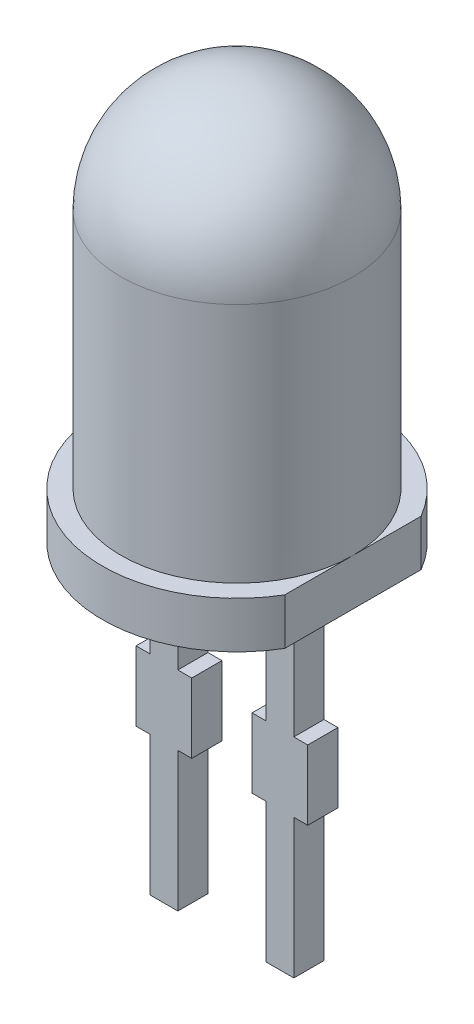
ISO-10303-21;
HEADER;
FILE_DESCRIPTION(('STEP AP214'),'2;1');
FILE_NAME('part.step','',(''),(''),'','','');
FILE_SCHEMA(('AUTOMOTIVE_DESIGN { 1 0 10303 214 1 1 1 1 }'));
ENDSEC;
DATA;
#1=APPLICATION_CONTEXT('core data for automotive mechanical design processes');
#2=APPLICATION_PROTOCOL_DEFINITION('international standard','automotive_design',2000,#1);
#3=PRODUCT_CONTEXT('',#1,'mechanical');
#4=PRODUCT('Part','Part','',(#3));
#5=PRODUCT_RELATED_PRODUCT_CATEGORY('part','',(#4));
#6=PRODUCT_DEFINITION_FORMATION('','',#4);
#7=PRODUCT_DEFINITION_CONTEXT('part definition',#1,'design');
#8=PRODUCT_DEFINITION('design','',#6,#7);
#9=PRODUCT_DEFINITION_SHAPE('','',#8);
#10=(LENGTH_UNIT() NAMED_UNIT(*) SI_UNIT(.MILLI.,.METRE.));
#11=(NAMED_UNIT(*) PLANE_ANGLE_UNIT() SI_UNIT($,.RADIAN.));
#12=(NAMED_UNIT(*) SI_UNIT($,.STERADIAN.) SOLID_ANGLE_UNIT());
#13=UNCERTAINTY_MEASURE_WITH_UNIT(LENGTH_MEASURE(1.E-05),#10,'distance_accuracy_value','');
#14=(GEOMETRIC_REPRESENTATION_CONTEXT(3) GLOBAL_UNCERTAINTY_ASSIGNED_CONTEXT((#13)) GLOBAL_UNIT_ASSIGNED_CONTEXT((#10,
#11,#12)) REPRESENTATION_CONTEXT('',''));
#15=CARTESIAN_POINT('',(0.,0.,0.));
#16=DIRECTION('',(0.,0.,1.));
#17=DIRECTION('',(1.,0.,0.));
#18=AXIS2_PLACEMENT_3D('',#15,#16,#17);
#19=CARTESIAN_POINT('',(2.9,4.2,0.));
#20=DIRECTION('',(0.,-1.,0.));
#21=DIRECTION('',(0.,0.,-1.));
#22=AXIS2_PLACEMENT_3D('',#19,#20,#21);
#23=PLANE('',#22);
#24=DIRECTION('',(0.,0.,-1.));
#25=VECTOR('',#24,1.);
#26=CARTESIAN_POINT('',(0.450000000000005,4.2,0.));
#27=LINE('',#26,#25);
#28=CARTESIAN_POINT('',(0.450000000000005,4.2,-0.825));
#29=VERTEX_POINT('',#28);
#30=CARTESIAN_POINT('',(0.450000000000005,4.2,0.825));
#31=VERTEX_POINT('',#30);
#32=EDGE_CURVE('E431',#29,#31,#27,.F.);
#33=ORIENTED_EDGE('',*,*,#32,.T.);
#34=DIRECTION('',(-1.,0.,0.));
#35=VECTOR('',#34,1.);
#36=CARTESIAN_POINT('',(1.55,4.2,0.825));
#37=LINE('',#36,#35);
#38=CARTESIAN_POINT('',(2.05,4.2,0.825));
#39=VERTEX_POINT('',#38);
#40=EDGE_CURVE('E437',#31,#39,#37,.F.);
#41=ORIENTED_EDGE('',*,*,#40,.T.);
#42=DIRECTION('',(0.,0.,-1.));
#43=VECTOR('',#42,1.);
#44=CARTESIAN_POINT('',(2.05,4.2,0.));
#45=LINE('',#44,#43);
#46=CARTESIAN_POINT('',(2.05,4.2,-0.825));
#47=VERTEX_POINT('',#46);
#48=EDGE_CURVE('E435',#39,#47,#45,.T.);
#49=ORIENTED_EDGE('',*,*,#48,.T.);
#50=DIRECTION('',(-1.,0.,0.));
#51=VECTOR('',#50,1.);
#52=CARTESIAN_POINT('',(2.9,4.2,-0.825));
#53=LINE('',#52,#51);
#54=EDGE_CURVE('E433',#47,#29,#53,.T.);
#55=ORIENTED_EDGE('',*,*,#54,.T.);
#56=EDGE_LOOP('',(#33,#41,#49,#55));
#57=FACE_BOUND('',#56,.T.);
#58=DIRECTION('',(-1.,0.,0.));
#59=VECTOR('',#58,1.);
#60=CARTESIAN_POINT('',(2.9,4.2,0.825));
#61=LINE('',#60,#59);
#62=CARTESIAN_POINT('',(-2.05,4.2,0.825));
#63=VERTEX_POINT('',#62);
#64=CARTESIAN_POINT('',(-0.450000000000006,4.2,0.825));
#65=VERTEX_POINT('',#64);
#66=EDGE_CURVE('E422',#63,#65,#61,.F.);
#67=ORIENTED_EDGE('',*,*,#66,.T.);
#68=DIRECTION('',(0.,0.,-1.));
#69=VECTOR('',#68,1.);
#70=CARTESIAN_POINT('',(-0.450000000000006,4.2,0.));
#71=LINE('',#70,#69);
#72=CARTESIAN_POINT('',(-0.450000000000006,4.2,-0.825));
#73=VERTEX_POINT('',#72);
#74=EDGE_CURVE('E428',#65,#73,#71,.T.);
#75=ORIENTED_EDGE('',*,*,#74,.T.);
#76=DIRECTION('',(-1.,0.,0.));
#77=VECTOR('',#76,1.);
#78=CARTESIAN_POINT('',(-1.55,4.2,-0.825));
#79=LINE('',#78,#77);
#80=CARTESIAN_POINT('',(-2.05,4.2,-0.825));
#81=VERTEX_POINT('',#80);
#82=EDGE_CURVE('E426',#73,#81,#79,.T.);
#83=ORIENTED_EDGE('',*,*,#82,.T.);
#84=DIRECTION('',(0.,0.,-1.));
#85=VECTOR('',#84,1.);
#86=CARTESIAN_POINT('',(-2.05,4.2,0.));
#87=LINE('',#86,#85);
#88=EDGE_CURVE('E424',#81,#63,#87,.F.);
#89=ORIENTED_EDGE('',*,*,#88,.T.);
#90=EDGE_LOOP('',(#67,#75,#83,#89));
#91=FACE_BOUND('',#90,.T.);
#92=DIRECTION('',(0.,0.,1.));
#93=VECTOR('',#92,1.);
#94=CARTESIAN_POINT('',(2.5,4.2,-1.4696938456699));
#95=LINE('',#94,#93);
#96=CARTESIAN_POINT('',(2.5,4.2,-1.4696938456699));
#97=VERTEX_POINT('',#96);
#98=CARTESIAN_POINT('',(2.5,4.2,1.4696938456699));
#99=VERTEX_POINT('',#98);
#100=EDGE_CURVE('E399',#97,#99,#95,.T.);
#101=ORIENTED_EDGE('',*,*,#100,.T.);
#102=CARTESIAN_POINT('',(0.,4.2,0.));
#103=DIRECTION('',(0.,-1.,0.));
#104=DIRECTION('',(0.,0.,-1.));
#105=AXIS2_PLACEMENT_3D('',#102,#103,#104);
#106=CIRCLE('',#105,2.9);
#107=EDGE_CURVE('E408',#99,#97,#106,.T.);
#108=ORIENTED_EDGE('',*,*,#107,.T.);
#109=EDGE_LOOP('',(#101,#108));
#110=FACE_BOUND('',#109,.T.);
#111=ADVANCED_FACE('F32',(#57,#91,#110),#23,.T.);
#112=CARTESIAN_POINT('',(0.,10.4,0.));
#113=DIRECTION('',(0.,-1.,0.));
#114=DIRECTION('',(1.,0.,0.));
#115=AXIS2_PLACEMENT_3D('',#112,#113,#114);
#116=SPHERICAL_SURFACE('',#115,2.5);
#117=CARTESIAN_POINT('',(0.,10.4,0.));
#118=DIRECTION('',(0.,-1.,0.));
#119=DIRECTION('',(0.,0.,-1.));
#120=AXIS2_PLACEMENT_3D('',#117,#118,#119);
#121=CIRCLE('',#120,2.5);
#122=CARTESIAN_POINT('',(0.,10.4,-2.5));
#123=VERTEX_POINT('',#122);
#124=EDGE_CURVE('E418',#123,#123,#121,.T.);
#125=ORIENTED_EDGE('',*,*,#124,.F.);
#126=EDGE_LOOP('',(#125));
#127=FACE_BOUND('',#126,.T.);
#128=ADVANCED_FACE('F496',(#127),#116,.T.);
#129=CARTESIAN_POINT('',(0.,4.2,0.));
#130=DIRECTION('',(0.,-1.,0.));
#131=DIRECTION('',(0.,0.,-1.));
#132=AXIS2_PLACEMENT_3D('',#129,#130,#131);
#133=CYLINDRICAL_SURFACE('',#132,2.5);
#134=ORIENTED_EDGE('',*,*,#124,.T.);
#135=EDGE_LOOP('',(#134));
#136=FACE_BOUND('',#135,.T.);
#137=CARTESIAN_POINT('',(0.,5.2,0.));
#138=DIRECTION('',(0.,-1.,0.));
#139=DIRECTION('',(0.,0.,-1.));
#140=AXIS2_PLACEMENT_3D('',#137,#138,#139);
#141=CIRCLE('',#140,2.5);
#142=CARTESIAN_POINT('',(2.5,5.2,0.));
#143=VERTEX_POINT('',#142);
#144=EDGE_CURVE('E415',#143,#143,#141,.T.);
#145=ORIENTED_EDGE('',*,*,#144,.F.);
#146=EDGE_LOOP('',(#145));
#147=FACE_BOUND('',#146,.T.);
#148=ADVANCED_FACE('F512',(#136,#147),#133,.T.);
#149=CARTESIAN_POINT('',(2.5,5.2,0.));
#150=DIRECTION('',(0.,1.,0.));
#151=DIRECTION('',(0.,0.,1.));
#152=AXIS2_PLACEMENT_3D('',#149,#150,#151);
#153=PLANE('',#152);
#154=DIRECTION('',(0.,0.,1.));
#155=VECTOR('',#154,1.);
#156=CARTESIAN_POINT('',(2.5,5.2,-1.4696938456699));
#157=LINE('',#156,#155);
#158=CARTESIAN_POINT('',(2.5,5.2,-1.4696938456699));
#159=VERTEX_POINT('',#158);
#160=EDGE_CURVE('E403',#159,#143,#157,.T.);
#161=ORIENTED_EDGE('',*,*,#160,.F.);
#162=CARTESIAN_POINT('',(0.,5.2,0.));
#163=DIRECTION('',(0.,-1.,0.));
#164=DIRECTION('',(0.,0.,-1.));
#165=AXIS2_PLACEMENT_3D('',#162,#163,#164);
#166=CIRCLE('',#165,2.9);
#167=CARTESIAN_POINT('',(2.5,5.2,1.4696938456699));
#168=VERTEX_POINT('',#167);
#169=EDGE_CURVE('E412',#168,#159,#166,.T.);
#170=ORIENTED_EDGE('',*,*,#169,.F.);
#171=EDGE_CURVE('E398',#143,#168,#157,.T.);
#172=ORIENTED_EDGE('',*,*,#171,.F.);
#173=ORIENTED_EDGE('',*,*,#144,.T.);
#174=EDGE_LOOP('',(#161,#170,#172,#173));
#175=FACE_BOUND('',#174,.T.);
#176=ADVANCED_FACE('F509',(#175),#153,.T.);
#177=CARTESIAN_POINT('',(0.,4.2,0.));
#178=DIRECTION('',(0.,-1.,0.));
#179=DIRECTION('',(0.,0.,-1.));
#180=AXIS2_PLACEMENT_3D('',#177,#178,#179);
#181=CYLINDRICAL_SURFACE('',#180,2.9);
#182=DIRECTION('',(0.,1.,0.));
#183=VECTOR('',#182,1.);
#184=CARTESIAN_POINT('',(2.5,4.2,-1.4696938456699));
#185=LINE('',#184,#183);
#186=EDGE_CURVE('E402',#97,#159,#185,.T.);
#187=ORIENTED_EDGE('',*,*,#186,.F.);
#188=ORIENTED_EDGE('',*,*,#107,.F.);
#189=DIRECTION('',(0.,1.,0.));
#190=VECTOR('',#189,1.);
#191=CARTESIAN_POINT('',(2.5,4.2,1.4696938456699));
#192=LINE('',#191,#190);
#193=EDGE_CURVE('E405',#99,#168,#192,.T.);
#194=ORIENTED_EDGE('',*,*,#193,.T.);
#195=ORIENTED_EDGE('',*,*,#169,.T.);
#196=EDGE_LOOP('',(#187,#188,#194,#195));
#197=FACE_BOUND('',#196,.T.);
#198=ADVANCED_FACE('F503',(#197),#181,.T.);
#199=CARTESIAN_POINT('',(2.5,4.2,-1.4696938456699));
#200=DIRECTION('',(-1.,0.,0.));
#201=DIRECTION('',(0.,0.,1.));
#202=AXIS2_PLACEMENT_3D('',#199,#200,#201);
#203=PLANE('',#202);
#204=ORIENTED_EDGE('',*,*,#160,.T.);
#205=ORIENTED_EDGE('',*,*,#171,.T.);
#206=ORIENTED_EDGE('',*,*,#193,.F.);
#207=ORIENTED_EDGE('',*,*,#100,.F.);
#208=ORIENTED_EDGE('',*,*,#186,.T.);
#209=EDGE_LOOP('',(#204,#205,#206,#207,#208));
#210=FACE_BOUND('',#209,.T.);
#211=ADVANCED_FACE('F506',(#210),#203,.F.);
#212=CARTESIAN_POINT('',(-1.55,4.2,0.325));
#213=DIRECTION('',(1.,0.,0.));
#214=DIRECTION('',(0.,1.,0.));
#215=AXIS2_PLACEMENT_3D('',#212,#213,#214);
#216=PLANE('',#215);
#217=DIRECTION('',(0.,-1.,0.));
#218=VECTOR('',#217,1.);
#219=CARTESIAN_POINT('',(-1.55,4.2,0.325));
#220=LINE('',#219,#218);
#221=CARTESIAN_POINT('',(-1.55,3.7,0.325));
#222=VERTEX_POINT('',#221);
#223=CARTESIAN_POINT('',(-1.55,1.5,0.325));
#224=VERTEX_POINT('',#223);
#225=EDGE_CURVE('E324',#222,#224,#220,.T.);
#226=ORIENTED_EDGE('',*,*,#225,.F.);
#227=DIRECTION('',(0.,0.,-1.));
#228=VECTOR('',#227,1.);
#229=CARTESIAN_POINT('',(-1.55,3.7,0.325));
#230=LINE('',#229,#228);
#231=CARTESIAN_POINT('',(-1.55,3.7,-0.325));
#232=VERTEX_POINT('',#231);
#233=EDGE_CURVE('E41',#222,#232,#230,.T.);
#234=ORIENTED_EDGE('',*,*,#233,.T.);
#235=DIRECTION('',(0.,-1.,0.));
#236=VECTOR('',#235,1.);
#237=CARTESIAN_POINT('',(-1.55,4.2,-0.325));
#238=LINE('',#237,#236);
#239=CARTESIAN_POINT('',(-1.55,1.5,-0.325));
#240=VERTEX_POINT('',#239);
#241=EDGE_CURVE('E251',#232,#240,#238,.T.);
#242=ORIENTED_EDGE('',*,*,#241,.T.);
#243=DIRECTION('',(0.,0.,-1.));
#244=VECTOR('',#243,1.);
#245=CARTESIAN_POINT('',(-1.55,1.5,0.325));
#246=LINE('',#245,#244);
#247=EDGE_CURVE('E395',#224,#240,#246,.T.);
#248=ORIENTED_EDGE('',*,*,#247,.F.);
#249=EDGE_LOOP('',(#226,#234,#242,#248));
#250=FACE_BOUND('',#249,.T.);
#251=ADVANCED_FACE('F756',(#250),#216,.F.);
#252=CARTESIAN_POINT('',(-1.55,1.5,0.325));
#253=DIRECTION('',(0.,-1.,0.));
#254=DIRECTION('',(0.,0.,-1.));
#255=AXIS2_PLACEMENT_3D('',#252,#253,#254);
#256=PLANE('',#255);
#257=DIRECTION('',(-1.,0.,0.));
#258=VECTOR('',#257,1.);
#259=CARTESIAN_POINT('',(-1.55,1.5,-0.325));
#260=LINE('',#259,#258);
#261=CARTESIAN_POINT('',(-1.85,1.5,-0.325));
#262=VERTEX_POINT('',#261);
#263=EDGE_CURVE('E349',#240,#262,#260,.T.);
#264=ORIENTED_EDGE('',*,*,#263,.T.);
#265=DIRECTION('',(0.,0.,-1.));
#266=VECTOR('',#265,1.);
#267=CARTESIAN_POINT('',(-1.85,1.5,0.325));
#268=LINE('',#267,#266);
#269=CARTESIAN_POINT('',(-1.85,1.5,0.325));
#270=VERTEX_POINT('',#269);
#271=EDGE_CURVE('E392',#270,#262,#268,.T.);
#272=ORIENTED_EDGE('',*,*,#271,.F.);
#273=DIRECTION('',(-1.,0.,0.));
#274=VECTOR('',#273,1.);
#275=CARTESIAN_POINT('',(-1.55,1.5,0.325));
#276=LINE('',#275,#274);
#277=EDGE_CURVE('E326',#224,#270,#276,.T.);
#278=ORIENTED_EDGE('',*,*,#277,.F.);
#279=ORIENTED_EDGE('',*,*,#247,.T.);
#280=EDGE_LOOP('',(#264,#272,#278,#279));
#281=FACE_BOUND('',#280,.T.);
#282=ADVANCED_FACE('F748',(#281),#256,.F.);
#283=CARTESIAN_POINT('',(-1.85,1.5,0.325));
#284=DIRECTION('',(1.,0.,0.));
#285=DIRECTION('',(0.,0.,-1.));
#286=AXIS2_PLACEMENT_3D('',#283,#284,#285);
#287=PLANE('',#286);
#288=DIRECTION('',(0.,-1.,0.));
#289=VECTOR('',#288,1.);
#290=CARTESIAN_POINT('',(-1.85,1.5,-0.325));
#291=LINE('',#290,#289);
#292=CARTESIAN_POINT('',(-1.85,0.,-0.325));
#293=VERTEX_POINT('',#292);
#294=EDGE_CURVE('E351',#262,#293,#291,.T.);
#295=ORIENTED_EDGE('',*,*,#294,.T.);
#296=DIRECTION('',(0.,0.,-1.));
#297=VECTOR('',#296,1.);
#298=CARTESIAN_POINT('',(-1.85,0.,0.325));
#299=LINE('',#298,#297);
#300=CARTESIAN_POINT('',(-1.85,0.,0.325));
#301=VERTEX_POINT('',#300);
#302=EDGE_CURVE('E389',#301,#293,#299,.T.);
#303=ORIENTED_EDGE('',*,*,#302,.F.);
#304=DIRECTION('',(0.,-1.,0.));
#305=VECTOR('',#304,1.);
#306=CARTESIAN_POINT('',(-1.85,1.5,0.325));
#307=LINE('',#306,#305);
#308=EDGE_CURVE('E329',#270,#301,#307,.T.);
#309=ORIENTED_EDGE('',*,*,#308,.F.);
#310=ORIENTED_EDGE('',*,*,#271,.T.);
#311=EDGE_LOOP('',(#295,#303,#309,#310));
#312=FACE_BOUND('',#311,.T.);
#313=ADVANCED_FACE('F740',(#312),#287,.F.);
#314=CARTESIAN_POINT('',(-1.85,0.,0.325));
#315=DIRECTION('',(0.,1.,0.));
#316=DIRECTION('',(0.,0.,1.));
#317=AXIS2_PLACEMENT_3D('',#314,#315,#316);
#318=PLANE('',#317);
#319=DIRECTION('',(1.,0.,0.));
#320=VECTOR('',#319,1.);
#321=CARTESIAN_POINT('',(-1.85,0.,-0.325));
#322=LINE('',#321,#320);
#323=CARTESIAN_POINT('',(-1.55,0.,-0.325));
#324=VERTEX_POINT('',#323);
#325=EDGE_CURVE('E353',#293,#324,#322,.T.);
#326=ORIENTED_EDGE('',*,*,#325,.T.);
#327=DIRECTION('',(0.,0.,-1.));
#328=VECTOR('',#327,1.);
#329=CARTESIAN_POINT('',(-1.55,0.,0.325));
#330=LINE('',#329,#328);
#331=CARTESIAN_POINT('',(-1.55,0.,0.325));
#332=VERTEX_POINT('',#331);
#333=EDGE_CURVE('E386',#332,#324,#330,.T.);
#334=ORIENTED_EDGE('',*,*,#333,.F.);
#335=DIRECTION('',(1.,0.,0.));
#336=VECTOR('',#335,1.);
#337=CARTESIAN_POINT('',(-1.85,0.,0.325));
#338=LINE('',#337,#336);
#339=EDGE_CURVE('E331',#301,#332,#338,.T.);
#340=ORIENTED_EDGE('',*,*,#339,.F.);
#341=ORIENTED_EDGE('',*,*,#302,.T.);
#342=EDGE_LOOP('',(#326,#334,#340,#341));
#343=FACE_BOUND('',#342,.T.);
#344=ADVANCED_FACE('F732',(#343),#318,.F.);
#345=CARTESIAN_POINT('',(-1.55,0.,0.325));
#346=DIRECTION('',(1.,0.,0.));
#347=DIRECTION('',(0.,0.,-1.));
#348=AXIS2_PLACEMENT_3D('',#345,#346,#347);
#349=PLANE('',#348);
#350=DIRECTION('',(0.,-1.,0.));
#351=VECTOR('',#350,1.);
#352=CARTESIAN_POINT('',(-1.55,0.,-0.325));
#353=LINE('',#352,#351);
#354=CARTESIAN_POINT('',(-1.55,-3.,-0.325));
#355=VERTEX_POINT('',#354);
#356=EDGE_CURVE('E355',#324,#355,#353,.T.);
#357=ORIENTED_EDGE('',*,*,#356,.T.);
#358=DIRECTION('',(0.,0.,-1.));
#359=VECTOR('',#358,1.);
#360=CARTESIAN_POINT('',(-1.55,-3.,0.325));
#361=LINE('',#360,#359);
#362=CARTESIAN_POINT('',(-1.55,-3.,0.325));
#363=VERTEX_POINT('',#362);
#364=EDGE_CURVE('E383',#363,#355,#361,.T.);
#365=ORIENTED_EDGE('',*,*,#364,.F.);
#366=DIRECTION('',(0.,-1.,0.));
#367=VECTOR('',#366,1.);
#368=CARTESIAN_POINT('',(-1.55,0.,0.325));
#369=LINE('',#368,#367);
#370=EDGE_CURVE('E333',#332,#363,#369,.T.);
#371=ORIENTED_EDGE('',*,*,#370,.F.);
#372=ORIENTED_EDGE('',*,*,#333,.T.);
#373=EDGE_LOOP('',(#357,#365,#371,#372));
#374=FACE_BOUND('',#373,.T.);
#375=ADVANCED_FACE('F724',(#374),#349,.F.);
#376=CARTESIAN_POINT('',(-1.55,-3.,0.325));
#377=DIRECTION('',(0.,1.,0.));
#378=DIRECTION('',(0.,0.,1.));
#379=AXIS2_PLACEMENT_3D('',#376,#377,#378);
#380=PLANE('',#379);
#381=DIRECTION('',(1.,0.,0.));
#382=VECTOR('',#381,1.);
#383=CARTESIAN_POINT('',(-1.55,-3.,-0.325));
#384=LINE('',#383,#382);
#385=CARTESIAN_POINT('',(-0.949999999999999,-3.,-0.325));
#386=VERTEX_POINT('',#385);
#387=EDGE_CURVE('E357',#355,#386,#384,.T.);
#388=ORIENTED_EDGE('',*,*,#387,.T.);
#389=DIRECTION('',(0.,0.,-1.));
#390=VECTOR('',#389,1.);
#391=CARTESIAN_POINT('',(-0.949999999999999,-3.,0.325));
#392=LINE('',#391,#390);
#393=CARTESIAN_POINT('',(-0.949999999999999,-3.,0.325));
#394=VERTEX_POINT('',#393);
#395=EDGE_CURVE('E380',#394,#386,#392,.T.);
#396=ORIENTED_EDGE('',*,*,#395,.F.);
#397=DIRECTION('',(1.,0.,0.));
#398=VECTOR('',#397,1.);
#399=CARTESIAN_POINT('',(-1.55,-3.,0.325));
#400=LINE('',#399,#398);
#401=EDGE_CURVE('E335',#363,#394,#400,.T.);
#402=ORIENTED_EDGE('',*,*,#401,.F.);
#403=ORIENTED_EDGE('',*,*,#364,.T.);
#404=EDGE_LOOP('',(#388,#396,#402,#403));
#405=FACE_BOUND('',#404,.T.);
#406=ADVANCED_FACE('F716',(#405),#380,.F.);
#407=CARTESIAN_POINT('',(-0.950000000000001,0.,0.325));
#408=DIRECTION('',(-1.,0.,0.));
#409=DIRECTION('',(0.,-1.,0.));
#410=AXIS2_PLACEMENT_3D('',#407,#408,#409);
#411=PLANE('',#410);
#412=DIRECTION('',(0.,1.,0.));
#413=VECTOR('',#412,1.);
#414=CARTESIAN_POINT('',(-0.950000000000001,0.,-0.325));
#415=LINE('',#414,#413);
#416=CARTESIAN_POINT('',(-0.950000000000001,0.,-0.325));
#417=VERTEX_POINT('',#416);
#418=EDGE_CURVE('E359',#386,#417,#415,.T.);
#419=ORIENTED_EDGE('',*,*,#418,.T.);
#420=DIRECTION('',(0.,0.,-1.));
#421=VECTOR('',#420,1.);
#422=CARTESIAN_POINT('',(-0.950000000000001,0.,0.325));
#423=LINE('',#422,#421);
#424=CARTESIAN_POINT('',(-0.950000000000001,0.,0.325));
#425=VERTEX_POINT('',#424);
#426=EDGE_CURVE('E377',#425,#417,#423,.T.);
#427=ORIENTED_EDGE('',*,*,#426,.F.);
#428=DIRECTION('',(0.,1.,0.));
#429=VECTOR('',#428,1.);
#430=CARTESIAN_POINT('',(-0.950000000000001,0.,0.325));
#431=LINE('',#430,#429);
#432=EDGE_CURVE('E337',#394,#425,#431,.T.);
#433=ORIENTED_EDGE('',*,*,#432,.F.);
#434=ORIENTED_EDGE('',*,*,#395,.T.);
#435=EDGE_LOOP('',(#419,#427,#433,#434));
#436=FACE_BOUND('',#435,.T.);
#437=ADVANCED_FACE('F708',(#436),#411,.F.);
#438=CARTESIAN_POINT('',(-0.65,0.,0.325));
#439=DIRECTION('',(0.,1.,0.));
#440=DIRECTION('',(-1.,0.,0.));
#441=AXIS2_PLACEMENT_3D('',#438,#439,#440);
#442=PLANE('',#441);
#443=DIRECTION('',(1.,0.,0.));
#444=VECTOR('',#443,1.);
#445=CARTESIAN_POINT('',(-0.65,0.,-0.325));
#446=LINE('',#445,#444);
#447=CARTESIAN_POINT('',(-0.65,0.,-0.325));
#448=VERTEX_POINT('',#447);
#449=EDGE_CURVE('E361',#417,#448,#446,.T.);
#450=ORIENTED_EDGE('',*,*,#449,.T.);
#451=DIRECTION('',(0.,0.,-1.));
#452=VECTOR('',#451,1.);
#453=CARTESIAN_POINT('',(-0.65,0.,0.325));
#454=LINE('',#453,#452);
#455=CARTESIAN_POINT('',(-0.65,0.,0.325));
#456=VERTEX_POINT('',#455);
#457=EDGE_CURVE('E374',#456,#448,#454,.T.);
#458=ORIENTED_EDGE('',*,*,#457,.F.);
#459=DIRECTION('',(1.,0.,0.));
#460=VECTOR('',#459,1.);
#461=CARTESIAN_POINT('',(-0.65,0.,0.325));
#462=LINE('',#461,#460);
#463=EDGE_CURVE('E339',#425,#456,#462,.T.);
#464=ORIENTED_EDGE('',*,*,#463,.F.);
#465=ORIENTED_EDGE('',*,*,#426,.T.);
#466=EDGE_LOOP('',(#450,#458,#464,#465));
#467=FACE_BOUND('',#466,.T.);
#468=ADVANCED_FACE('F700',(#467),#442,.F.);
#469=CARTESIAN_POINT('',(-0.650000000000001,1.5,0.325));
#470=DIRECTION('',(-1.,0.,0.));
#471=DIRECTION('',(0.,-1.,0.));
#472=AXIS2_PLACEMENT_3D('',#469,#470,#471);
#473=PLANE('',#472);
#474=DIRECTION('',(0.,1.,0.));
#475=VECTOR('',#474,1.);
#476=CARTESIAN_POINT('',(-0.650000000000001,1.5,-0.325));
#477=LINE('',#476,#475);
#478=CARTESIAN_POINT('',(-0.650000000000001,1.5,-0.325));
#479=VERTEX_POINT('',#478);
#480=EDGE_CURVE('E363',#448,#479,#477,.T.);
#481=ORIENTED_EDGE('',*,*,#480,.T.);
#482=DIRECTION('',(0.,0.,-1.));
#483=VECTOR('',#482,1.);
#484=CARTESIAN_POINT('',(-0.650000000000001,1.5,0.325));
#485=LINE('',#484,#483);
#486=CARTESIAN_POINT('',(-0.650000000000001,1.5,0.325));
#487=VERTEX_POINT('',#486);
#488=EDGE_CURVE('E371',#487,#479,#485,.T.);
#489=ORIENTED_EDGE('',*,*,#488,.F.);
#490=DIRECTION('',(0.,1.,0.));
#491=VECTOR('',#490,1.);
#492=CARTESIAN_POINT('',(-0.650000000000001,1.5,0.325));
#493=LINE('',#492,#491);
#494=EDGE_CURVE('E341',#456,#487,#493,.T.);
#495=ORIENTED_EDGE('',*,*,#494,.F.);
#496=ORIENTED_EDGE('',*,*,#457,.T.);
#497=EDGE_LOOP('',(#481,#489,#495,#496));
#498=FACE_BOUND('',#497,.T.);
#499=ADVANCED_FACE('F692',(#498),#473,.F.);
#500=CARTESIAN_POINT('',(-0.950000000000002,1.5,0.325));
#501=DIRECTION('',(0.,-1.,0.));
#502=DIRECTION('',(0.,0.,-1.));
#503=AXIS2_PLACEMENT_3D('',#500,#501,#502);
#504=PLANE('',#503);
#505=DIRECTION('',(-1.,0.,0.));
#506=VECTOR('',#505,1.);
#507=CARTESIAN_POINT('',(-0.950000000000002,1.5,-0.325));
#508=LINE('',#507,#506);
#509=CARTESIAN_POINT('',(-0.950000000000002,1.5,-0.325));
#510=VERTEX_POINT('',#509);
#511=EDGE_CURVE('E365',#479,#510,#508,.T.);
#512=ORIENTED_EDGE('',*,*,#511,.T.);
#513=DIRECTION('',(0.,0.,-1.));
#514=VECTOR('',#513,1.);
#515=CARTESIAN_POINT('',(-0.950000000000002,1.5,0.325));
#516=LINE('',#515,#514);
#517=CARTESIAN_POINT('',(-0.950000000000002,1.5,0.325));
#518=VERTEX_POINT('',#517);
#519=EDGE_CURVE('E347',#518,#510,#516,.T.);
#520=ORIENTED_EDGE('',*,*,#519,.F.);
#521=DIRECTION('',(-1.,0.,0.));
#522=VECTOR('',#521,1.);
#523=CARTESIAN_POINT('',(-0.950000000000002,1.5,0.325));
#524=LINE('',#523,#522);
#525=EDGE_CURVE('E343',#487,#518,#524,.T.);
#526=ORIENTED_EDGE('',*,*,#525,.F.);
#527=ORIENTED_EDGE('',*,*,#488,.T.);
#528=EDGE_LOOP('',(#512,#520,#526,#527));
#529=FACE_BOUND('',#528,.T.);
#530=ADVANCED_FACE('F685',(#529),#504,.F.);
#531=CARTESIAN_POINT('',(-0.950000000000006,4.2,0.325));
#532=DIRECTION('',(-1.,0.,0.));
#533=DIRECTION('',(0.,-1.,0.));
#534=AXIS2_PLACEMENT_3D('',#531,#532,#533);
#535=PLANE('',#534);
#536=DIRECTION('',(0.,1.,0.));
#537=VECTOR('',#536,1.);
#538=CARTESIAN_POINT('',(-0.950000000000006,4.2,-0.325));
#539=LINE('',#538,#537);
#540=CARTESIAN_POINT('',(-0.950000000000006,3.7,-0.325));
#541=VERTEX_POINT('',#540);
#542=EDGE_CURVE('E327',#510,#541,#539,.T.);
#543=ORIENTED_EDGE('',*,*,#542,.T.);
#544=DIRECTION('',(0.,0.,-1.));
#545=VECTOR('',#544,1.);
#546=CARTESIAN_POINT('',(-0.950000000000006,3.7,0.325));
#547=LINE('',#546,#545);
#548=CARTESIAN_POINT('',(-0.950000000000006,3.7,0.325));
#549=VERTEX_POINT('',#548);
#550=EDGE_CURVE('E446',#541,#549,#547,.F.);
#551=ORIENTED_EDGE('',*,*,#550,.T.);
#552=DIRECTION('',(0.,1.,0.));
#553=VECTOR('',#552,1.);
#554=CARTESIAN_POINT('',(-0.950000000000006,4.2,0.325));
#555=LINE('',#554,#553);
#556=EDGE_CURVE('E345',#518,#549,#555,.T.);
#557=ORIENTED_EDGE('',*,*,#556,.F.);
#558=ORIENTED_EDGE('',*,*,#519,.T.);
#559=EDGE_LOOP('',(#543,#551,#557,#558));
#560=FACE_BOUND('',#559,.T.);
#561=ADVANCED_FACE('F487',(#560),#535,.F.);
#562=CARTESIAN_POINT('',(-1.55,4.2,0.325));
#563=DIRECTION('',(0.,0.,-1.));
#564=DIRECTION('',(-1.,0.,0.));
#565=AXIS2_PLACEMENT_3D('',#562,#563,#564);
#566=PLANE('',#565);
#567=ORIENTED_EDGE('',*,*,#556,.T.);
#568=DIRECTION('',(-1.,0.,0.));
#569=VECTOR('',#568,1.);
#570=CARTESIAN_POINT('',(-1.55,3.7,0.325));
#571=LINE('',#570,#569);
#572=EDGE_CURVE('E11',#549,#222,#571,.T.);
#573=ORIENTED_EDGE('',*,*,#572,.T.);
#574=ORIENTED_EDGE('',*,*,#225,.T.);
#575=ORIENTED_EDGE('',*,*,#277,.T.);
#576=ORIENTED_EDGE('',*,*,#308,.T.);
#577=ORIENTED_EDGE('',*,*,#339,.T.);
#578=ORIENTED_EDGE('',*,*,#370,.T.);
#579=ORIENTED_EDGE('',*,*,#401,.T.);
#580=ORIENTED_EDGE('',*,*,#432,.T.);
#581=ORIENTED_EDGE('',*,*,#463,.T.);
#582=ORIENTED_EDGE('',*,*,#494,.T.);
#583=ORIENTED_EDGE('',*,*,#525,.T.);
#584=EDGE_LOOP('',(#567,#573,#574,#575,#576,#577,#578,#579,#580,#581,#582,#583));
#585=FACE_BOUND('',#584,.T.);
#586=ADVANCED_FACE('F672',(#585),#566,.F.);
#587=CARTESIAN_POINT('',(-1.55,4.2,-0.325));
#588=DIRECTION('',(0.,0.,-1.));
#589=DIRECTION('',(-1.,0.,0.));
#590=AXIS2_PLACEMENT_3D('',#587,#588,#589);
#591=PLANE('',#590);
#592=ORIENTED_EDGE('',*,*,#241,.F.);
#593=DIRECTION('',(-1.,0.,0.));
#594=VECTOR('',#593,1.);
#595=CARTESIAN_POINT('',(-0.950000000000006,3.7,-0.325));
#596=LINE('',#595,#594);
#597=EDGE_CURVE('E449',#232,#541,#596,.F.);
#598=ORIENTED_EDGE('',*,*,#597,.T.);
#599=ORIENTED_EDGE('',*,*,#542,.F.);
#600=ORIENTED_EDGE('',*,*,#511,.F.);
#601=ORIENTED_EDGE('',*,*,#480,.F.);
#602=ORIENTED_EDGE('',*,*,#449,.F.);
#603=ORIENTED_EDGE('',*,*,#418,.F.);
#604=ORIENTED_EDGE('',*,*,#387,.F.);
#605=ORIENTED_EDGE('',*,*,#356,.F.);
#606=ORIENTED_EDGE('',*,*,#325,.F.);
#607=ORIENTED_EDGE('',*,*,#294,.F.);
#608=ORIENTED_EDGE('',*,*,#263,.F.);
#609=EDGE_LOOP('',(#592,#598,#599,#600,#601,#602,#603,#604,#605,#606,#607,#608));
#610=FACE_BOUND('',#609,.T.);
#611=ADVANCED_FACE('F482',(#610),#591,.T.);
#612=CARTESIAN_POINT('',(0.950000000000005,4.2,0.325));
#613=DIRECTION('',(1.,0.,0.));
#614=DIRECTION('',(0.,1.,0.));
#615=AXIS2_PLACEMENT_3D('',#612,#613,#614);
#616=PLANE('',#615);
#617=DIRECTION('',(0.,-1.,0.));
#618=VECTOR('',#617,1.);
#619=CARTESIAN_POINT('',(0.950000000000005,4.2,0.325));
#620=LINE('',#619,#618);
#621=CARTESIAN_POINT('',(0.950000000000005,3.7,0.325));
#622=VERTEX_POINT('',#621);
#623=CARTESIAN_POINT('',(0.950000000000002,1.5,0.325));
#624=VERTEX_POINT('',#623);
#625=EDGE_CURVE('E232',#622,#624,#620,.T.);
#626=ORIENTED_EDGE('',*,*,#625,.F.);
#627=DIRECTION('',(0.,0.,-1.));
#628=VECTOR('',#627,1.);
#629=CARTESIAN_POINT('',(0.950000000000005,3.7,0.325));
#630=LINE('',#629,#628);
#631=CARTESIAN_POINT('',(0.950000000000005,3.7,-0.325));
#632=VERTEX_POINT('',#631);
#633=EDGE_CURVE('E444',#622,#632,#630,.T.);
#634=ORIENTED_EDGE('',*,*,#633,.T.);
#635=DIRECTION('',(0.,-1.,0.));
#636=VECTOR('',#635,1.);
#637=CARTESIAN_POINT('',(0.950000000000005,4.2,-0.325));
#638=LINE('',#637,#636);
#639=CARTESIAN_POINT('',(0.950000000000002,1.5,-0.325));
#640=VERTEX_POINT('',#639);
#641=EDGE_CURVE('E248',#632,#640,#638,.T.);
#642=ORIENTED_EDGE('',*,*,#641,.T.);
#643=DIRECTION('',(0.,0.,-1.));
#644=VECTOR('',#643,1.);
#645=CARTESIAN_POINT('',(0.950000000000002,1.5,0.325));
#646=LINE('',#645,#644);
#647=EDGE_CURVE('E245',#624,#640,#646,.T.);
#648=ORIENTED_EDGE('',*,*,#647,.F.);
#649=EDGE_LOOP('',(#626,#634,#642,#648));
#650=FACE_BOUND('',#649,.T.);
#651=ADVANCED_FACE('F246',(#650),#616,.F.);
#652=CARTESIAN_POINT('',(0.950000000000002,1.5,0.325));
#653=DIRECTION('',(0.,-1.,0.));
#654=DIRECTION('',(0.,0.,-1.));
#655=AXIS2_PLACEMENT_3D('',#652,#653,#654);
#656=PLANE('',#655);
#657=DIRECTION('',(-1.,0.,0.));
#658=VECTOR('',#657,1.);
#659=CARTESIAN_POINT('',(0.950000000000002,1.5,-0.325));
#660=LINE('',#659,#658);
#661=CARTESIAN_POINT('',(0.65,1.5,-0.325));
#662=VERTEX_POINT('',#661);
#663=EDGE_CURVE('E279',#640,#662,#660,.T.);
#664=ORIENTED_EDGE('',*,*,#663,.T.);
#665=DIRECTION('',(0.,0.,-1.));
#666=VECTOR('',#665,1.);
#667=CARTESIAN_POINT('',(0.65,1.5,0.325));
#668=LINE('',#667,#666);
#669=CARTESIAN_POINT('',(0.65,1.5,0.325));
#670=VERTEX_POINT('',#669);
#671=EDGE_CURVE('E252',#670,#662,#668,.T.);
#672=ORIENTED_EDGE('',*,*,#671,.F.);
#673=DIRECTION('',(-1.,0.,0.));
#674=VECTOR('',#673,1.);
#675=CARTESIAN_POINT('',(0.950000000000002,1.5,0.325));
#676=LINE('',#675,#674);
#677=EDGE_CURVE('E237',#624,#670,#676,.T.);
#678=ORIENTED_EDGE('',*,*,#677,.F.);
#679=ORIENTED_EDGE('',*,*,#647,.T.);
#680=EDGE_LOOP('',(#664,#672,#678,#679));
#681=FACE_BOUND('',#680,.T.);
#682=ADVANCED_FACE('F254',(#681),#656,.F.);
#683=CARTESIAN_POINT('',(0.65,1.5,0.325));
#684=DIRECTION('',(1.,0.,0.));
#685=DIRECTION('',(0.,1.,0.));
#686=AXIS2_PLACEMENT_3D('',#683,#684,#685);
#687=PLANE('',#686);
#688=DIRECTION('',(0.,-1.,0.));
#689=VECTOR('',#688,1.);
#690=CARTESIAN_POINT('',(0.65,1.5,-0.325));
#691=LINE('',#690,#689);
#692=CARTESIAN_POINT('',(0.65,0.,-0.325));
#693=VERTEX_POINT('',#692);
#694=EDGE_CURVE('E282',#662,#693,#691,.T.);
#695=ORIENTED_EDGE('',*,*,#694,.T.);
#696=DIRECTION('',(0.,0.,-1.));
#697=VECTOR('',#696,1.);
#698=CARTESIAN_POINT('',(0.65,0.,0.325));
#699=LINE('',#698,#697);
#700=CARTESIAN_POINT('',(0.65,0.,0.325));
#701=VERTEX_POINT('',#700);
#702=EDGE_CURVE('E320',#701,#693,#699,.T.);
#703=ORIENTED_EDGE('',*,*,#702,.F.);
#704=DIRECTION('',(0.,-1.,0.));
#705=VECTOR('',#704,1.);
#706=CARTESIAN_POINT('',(0.65,1.5,0.325));
#707=LINE('',#706,#705);
#708=EDGE_CURVE('E257',#670,#701,#707,.T.);
#709=ORIENTED_EDGE('',*,*,#708,.F.);
#710=ORIENTED_EDGE('',*,*,#671,.T.);
#711=EDGE_LOOP('',(#695,#703,#709,#710));
#712=FACE_BOUND('',#711,.T.);
#713=ADVANCED_FACE('F645',(#712),#687,.F.);
#714=CARTESIAN_POINT('',(0.65,0.,0.325));
#715=DIRECTION('',(0.,1.,0.));
#716=DIRECTION('',(0.,0.,1.));
#717=AXIS2_PLACEMENT_3D('',#714,#715,#716);
#718=PLANE('',#717);
#719=DIRECTION('',(1.,0.,0.));
#720=VECTOR('',#719,1.);
#721=CARTESIAN_POINT('',(0.65,0.,-0.325));
#722=LINE('',#721,#720);
#723=CARTESIAN_POINT('',(0.950000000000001,0.,-0.325));
#724=VERTEX_POINT('',#723);
#725=EDGE_CURVE('E284',#693,#724,#722,.T.);
#726=ORIENTED_EDGE('',*,*,#725,.T.);
#727=DIRECTION('',(0.,0.,-1.));
#728=VECTOR('',#727,1.);
#729=CARTESIAN_POINT('',(0.950000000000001,0.,0.325));
#730=LINE('',#729,#728);
#731=CARTESIAN_POINT('',(0.950000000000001,0.,0.325));
#732=VERTEX_POINT('',#731);
#733=EDGE_CURVE('E317',#732,#724,#730,.T.);
#734=ORIENTED_EDGE('',*,*,#733,.F.);
#735=DIRECTION('',(1.,0.,0.));
#736=VECTOR('',#735,1.);
#737=CARTESIAN_POINT('',(0.65,0.,0.325));
#738=LINE('',#737,#736);
#739=EDGE_CURVE('E259',#701,#732,#738,.T.);
#740=ORIENTED_EDGE('',*,*,#739,.F.);
#741=ORIENTED_EDGE('',*,*,#702,.T.);
#742=EDGE_LOOP('',(#726,#734,#740,#741));
#743=FACE_BOUND('',#742,.T.);
#744=ADVANCED_FACE('F637',(#743),#718,.F.);
#745=CARTESIAN_POINT('',(0.950000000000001,0.,0.325));
#746=DIRECTION('',(1.,0.,0.));
#747=DIRECTION('',(0.,1.,0.));
#748=AXIS2_PLACEMENT_3D('',#745,#746,#747);
#749=PLANE('',#748);
#750=DIRECTION('',(0.,-1.,0.));
#751=VECTOR('',#750,1.);
#752=CARTESIAN_POINT('',(0.950000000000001,0.,-0.325));
#753=LINE('',#752,#751);
#754=CARTESIAN_POINT('',(0.95,-3.,-0.325));
#755=VERTEX_POINT('',#754);
#756=EDGE_CURVE('E286',#724,#755,#753,.T.);
#757=ORIENTED_EDGE('',*,*,#756,.T.);
#758=DIRECTION('',(0.,0.,-1.));
#759=VECTOR('',#758,1.);
#760=CARTESIAN_POINT('',(0.95,-3.,0.325));
#761=LINE('',#760,#759);
#762=CARTESIAN_POINT('',(0.95,-3.,0.325));
#763=VERTEX_POINT('',#762);
#764=EDGE_CURVE('E314',#763,#755,#761,.T.);
#765=ORIENTED_EDGE('',*,*,#764,.F.);
#766=DIRECTION('',(0.,-1.,0.));
#767=VECTOR('',#766,1.);
#768=CARTESIAN_POINT('',(0.950000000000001,0.,0.325));
#769=LINE('',#768,#767);
#770=EDGE_CURVE('E263',#732,#763,#769,.T.);
#771=ORIENTED_EDGE('',*,*,#770,.F.);
#772=ORIENTED_EDGE('',*,*,#733,.T.);
#773=EDGE_LOOP('',(#757,#765,#771,#772));
#774=FACE_BOUND('',#773,.T.);
#775=ADVANCED_FACE('F629',(#774),#749,.F.);
#776=CARTESIAN_POINT('',(1.55,-3.,0.325));
#777=DIRECTION('',(0.,1.,0.));
#778=DIRECTION('',(0.,0.,1.));
#779=AXIS2_PLACEMENT_3D('',#776,#777,#778);
#780=PLANE('',#779);
#781=DIRECTION('',(1.,0.,0.));
#782=VECTOR('',#781,1.);
#783=CARTESIAN_POINT('',(1.55,-3.,-0.325));
#784=LINE('',#783,#782);
#785=CARTESIAN_POINT('',(1.55,-3.,-0.325));
#786=VERTEX_POINT('',#785);
#787=EDGE_CURVE('E288',#755,#786,#784,.T.);
#788=ORIENTED_EDGE('',*,*,#787,.T.);
#789=DIRECTION('',(0.,0.,-1.));
#790=VECTOR('',#789,1.);
#791=CARTESIAN_POINT('',(1.55,-3.,0.325));
#792=LINE('',#791,#790);
#793=CARTESIAN_POINT('',(1.55,-3.,0.325));
#794=VERTEX_POINT('',#793);
#795=EDGE_CURVE('E311',#794,#786,#792,.T.);
#796=ORIENTED_EDGE('',*,*,#795,.F.);
#797=DIRECTION('',(1.,0.,0.));
#798=VECTOR('',#797,1.);
#799=CARTESIAN_POINT('',(1.55,-3.,0.325));
#800=LINE('',#799,#798);
#801=EDGE_CURVE('E265',#763,#794,#800,.T.);
#802=ORIENTED_EDGE('',*,*,#801,.F.);
#803=ORIENTED_EDGE('',*,*,#764,.T.);
#804=EDGE_LOOP('',(#788,#796,#802,#803));
#805=FACE_BOUND('',#804,.T.);
#806=ADVANCED_FACE('F621',(#805),#780,.F.);
#807=CARTESIAN_POINT('',(1.55,0.,0.325));
#808=DIRECTION('',(-1.,0.,0.));
#809=DIRECTION('',(0.,-1.,0.));
#810=AXIS2_PLACEMENT_3D('',#807,#808,#809);
#811=PLANE('',#810);
#812=DIRECTION('',(0.,1.,0.));
#813=VECTOR('',#812,1.);
#814=CARTESIAN_POINT('',(1.55,0.,-0.325));
#815=LINE('',#814,#813);
#816=CARTESIAN_POINT('',(1.55,0.,-0.325));
#817=VERTEX_POINT('',#816);
#818=EDGE_CURVE('E290',#786,#817,#815,.T.);
#819=ORIENTED_EDGE('',*,*,#818,.T.);
#820=DIRECTION('',(0.,0.,-1.));
#821=VECTOR('',#820,1.);
#822=CARTESIAN_POINT('',(1.55,0.,0.325));
#823=LINE('',#822,#821);
#824=CARTESIAN_POINT('',(1.55,0.,0.325));
#825=VERTEX_POINT('',#824);
#826=EDGE_CURVE('E308',#825,#817,#823,.T.);
#827=ORIENTED_EDGE('',*,*,#826,.F.);
#828=DIRECTION('',(0.,1.,0.));
#829=VECTOR('',#828,1.);
#830=CARTESIAN_POINT('',(1.55,0.,0.325));
#831=LINE('',#830,#829);
#832=EDGE_CURVE('E267',#794,#825,#831,.T.);
#833=ORIENTED_EDGE('',*,*,#832,.F.);
#834=ORIENTED_EDGE('',*,*,#795,.T.);
#835=EDGE_LOOP('',(#819,#827,#833,#834));
#836=FACE_BOUND('',#835,.T.);
#837=ADVANCED_FACE('F613',(#836),#811,.F.);
#838=CARTESIAN_POINT('',(1.85,0.,0.325));
#839=DIRECTION('',(0.,1.,0.));
#840=DIRECTION('',(0.,0.,1.));
#841=AXIS2_PLACEMENT_3D('',#838,#839,#840);
#842=PLANE('',#841);
#843=DIRECTION('',(1.,0.,0.));
#844=VECTOR('',#843,1.);
#845=CARTESIAN_POINT('',(1.85,0.,-0.325));
#846=LINE('',#845,#844);
#847=CARTESIAN_POINT('',(1.85,0.,-0.325));
#848=VERTEX_POINT('',#847);
#849=EDGE_CURVE('E292',#817,#848,#846,.T.);
#850=ORIENTED_EDGE('',*,*,#849,.T.);
#851=DIRECTION('',(0.,0.,-1.));
#852=VECTOR('',#851,1.);
#853=CARTESIAN_POINT('',(1.85,0.,0.325));
#854=LINE('',#853,#852);
#855=CARTESIAN_POINT('',(1.85,0.,0.325));
#856=VERTEX_POINT('',#855);
#857=EDGE_CURVE('E305',#856,#848,#854,.T.);
#858=ORIENTED_EDGE('',*,*,#857,.F.);
#859=DIRECTION('',(1.,0.,0.));
#860=VECTOR('',#859,1.);
#861=CARTESIAN_POINT('',(1.85,0.,0.325));
#862=LINE('',#861,#860);
#863=EDGE_CURVE('E269',#825,#856,#862,.T.);
#864=ORIENTED_EDGE('',*,*,#863,.F.);
#865=ORIENTED_EDGE('',*,*,#826,.T.);
#866=EDGE_LOOP('',(#850,#858,#864,#865));
#867=FACE_BOUND('',#866,.T.);
#868=ADVANCED_FACE('F605',(#867),#842,.F.);
#869=CARTESIAN_POINT('',(1.85,1.5,0.325));
#870=DIRECTION('',(-1.,0.,0.));
#871=DIRECTION('',(0.,-1.,0.));
#872=AXIS2_PLACEMENT_3D('',#869,#870,#871);
#873=PLANE('',#872);
#874=DIRECTION('',(0.,1.,0.));
#875=VECTOR('',#874,1.);
#876=CARTESIAN_POINT('',(1.85,1.5,-0.325));
#877=LINE('',#876,#875);
#878=CARTESIAN_POINT('',(1.85,1.5,-0.325));
#879=VERTEX_POINT('',#878);
#880=EDGE_CURVE('E294',#848,#879,#877,.T.);
#881=ORIENTED_EDGE('',*,*,#880,.T.);
#882=DIRECTION('',(0.,0.,-1.));
#883=VECTOR('',#882,1.);
#884=CARTESIAN_POINT('',(1.85,1.5,0.325));
#885=LINE('',#884,#883);
#886=CARTESIAN_POINT('',(1.85,1.5,0.325));
#887=VERTEX_POINT('',#886);
#888=EDGE_CURVE('E302',#887,#879,#885,.T.);
#889=ORIENTED_EDGE('',*,*,#888,.F.);
#890=DIRECTION('',(0.,1.,0.));
#891=VECTOR('',#890,1.);
#892=CARTESIAN_POINT('',(1.85,1.5,0.325));
#893=LINE('',#892,#891);
#894=EDGE_CURVE('E271',#856,#887,#893,.T.);
#895=ORIENTED_EDGE('',*,*,#894,.F.);
#896=ORIENTED_EDGE('',*,*,#857,.T.);
#897=EDGE_LOOP('',(#881,#889,#895,#896));
#898=FACE_BOUND('',#897,.T.);
#899=ADVANCED_FACE('F596',(#898),#873,.F.);
#900=CARTESIAN_POINT('',(1.55,1.5,0.325));
#901=DIRECTION('',(0.,-1.,0.));
#902=DIRECTION('',(0.,0.,-1.));
#903=AXIS2_PLACEMENT_3D('',#900,#901,#902);
#904=PLANE('',#903);
#905=DIRECTION('',(-1.,0.,0.));
#906=VECTOR('',#905,1.);
#907=CARTESIAN_POINT('',(1.55,1.5,-0.325));
#908=LINE('',#907,#906);
#909=CARTESIAN_POINT('',(1.55,1.5,-0.325));
#910=VERTEX_POINT('',#909);
#911=EDGE_CURVE('E296',#879,#910,#908,.T.);
#912=ORIENTED_EDGE('',*,*,#911,.T.);
#913=DIRECTION('',(0.,0.,-1.));
#914=VECTOR('',#913,1.);
#915=CARTESIAN_POINT('',(1.55,1.5,0.325));
#916=LINE('',#915,#914);
#917=CARTESIAN_POINT('',(1.55,1.5,0.325));
#918=VERTEX_POINT('',#917);
#919=EDGE_CURVE('E277',#918,#910,#916,.T.);
#920=ORIENTED_EDGE('',*,*,#919,.F.);
#921=DIRECTION('',(-1.,0.,0.));
#922=VECTOR('',#921,1.);
#923=CARTESIAN_POINT('',(1.55,1.5,0.325));
#924=LINE('',#923,#922);
#925=EDGE_CURVE('E273',#887,#918,#924,.T.);
#926=ORIENTED_EDGE('',*,*,#925,.F.);
#927=ORIENTED_EDGE('',*,*,#888,.T.);
#928=EDGE_LOOP('',(#912,#920,#926,#927));
#929=FACE_BOUND('',#928,.T.);
#930=ADVANCED_FACE('F587',(#929),#904,.F.);
#931=CARTESIAN_POINT('',(1.55,4.2,0.325));
#932=DIRECTION('',(-1.,0.,0.));
#933=DIRECTION('',(0.,0.,1.));
#934=AXIS2_PLACEMENT_3D('',#931,#932,#933);
#935=PLANE('',#934);
#936=DIRECTION('',(0.,1.,0.));
#937=VECTOR('',#936,1.);
#938=CARTESIAN_POINT('',(1.55,4.2,-0.325));
#939=LINE('',#938,#937);
#940=CARTESIAN_POINT('',(1.55,3.7,-0.325));
#941=VERTEX_POINT('',#940);
#942=EDGE_CURVE('E242',#910,#941,#939,.T.);
#943=ORIENTED_EDGE('',*,*,#942,.T.);
#944=DIRECTION('',(0.,0.,-1.));
#945=VECTOR('',#944,1.);
#946=CARTESIAN_POINT('',(1.55,3.7,0.325));
#947=LINE('',#946,#945);
#948=CARTESIAN_POINT('',(1.55,3.7,0.325));
#949=VERTEX_POINT('',#948);
#950=EDGE_CURVE('E440',#941,#949,#947,.F.);
#951=ORIENTED_EDGE('',*,*,#950,.T.);
#952=DIRECTION('',(0.,1.,0.));
#953=VECTOR('',#952,1.);
#954=CARTESIAN_POINT('',(1.55,4.2,0.325));
#955=LINE('',#954,#953);
#956=EDGE_CURVE('E275',#918,#949,#955,.T.);
#957=ORIENTED_EDGE('',*,*,#956,.F.);
#958=ORIENTED_EDGE('',*,*,#919,.T.);
#959=EDGE_LOOP('',(#943,#951,#957,#958));
#960=FACE_BOUND('',#959,.T.);
#961=ADVANCED_FACE('F580',(#960),#935,.F.);
#962=CARTESIAN_POINT('',(1.55,4.2,0.325));
#963=DIRECTION('',(0.,0.,1.));
#964=DIRECTION('',(1.,0.,0.));
#965=AXIS2_PLACEMENT_3D('',#962,#963,#964);
#966=PLANE('',#965);
#967=ORIENTED_EDGE('',*,*,#956,.T.);
#968=DIRECTION('',(-1.,0.,0.));
#969=VECTOR('',#968,1.);
#970=CARTESIAN_POINT('',(0.950000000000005,3.7,0.325));
#971=LINE('',#970,#969);
#972=EDGE_CURVE('E240',#949,#622,#971,.T.);
#973=ORIENTED_EDGE('',*,*,#972,.T.);
#974=ORIENTED_EDGE('',*,*,#625,.T.);
#975=ORIENTED_EDGE('',*,*,#677,.T.);
#976=ORIENTED_EDGE('',*,*,#708,.T.);
#977=ORIENTED_EDGE('',*,*,#739,.T.);
#978=ORIENTED_EDGE('',*,*,#770,.T.);
#979=ORIENTED_EDGE('',*,*,#801,.T.);
#980=ORIENTED_EDGE('',*,*,#832,.T.);
#981=ORIENTED_EDGE('',*,*,#863,.T.);
#982=ORIENTED_EDGE('',*,*,#894,.T.);
#983=ORIENTED_EDGE('',*,*,#925,.T.);
#984=EDGE_LOOP('',(#967,#973,#974,#975,#976,#977,#978,#979,#980,#981,#982,#983));
#985=FACE_BOUND('',#984,.T.);
#986=ADVANCED_FACE('F235',(#985),#966,.T.);
#987=CARTESIAN_POINT('',(1.55,4.2,-0.325));
#988=DIRECTION('',(0.,0.,1.));
#989=DIRECTION('',(1.,0.,0.));
#990=AXIS2_PLACEMENT_3D('',#987,#988,#989);
#991=PLANE('',#990);
#992=ORIENTED_EDGE('',*,*,#641,.F.);
#993=DIRECTION('',(-1.,0.,0.));
#994=VECTOR('',#993,1.);
#995=CARTESIAN_POINT('',(1.55,3.7,-0.325));
#996=LINE('',#995,#994);
#997=EDGE_CURVE('E442',#632,#941,#996,.F.);
#998=ORIENTED_EDGE('',*,*,#997,.T.);
#999=ORIENTED_EDGE('',*,*,#942,.F.);
#1000=ORIENTED_EDGE('',*,*,#911,.F.);
#1001=ORIENTED_EDGE('',*,*,#880,.F.);
#1002=ORIENTED_EDGE('',*,*,#849,.F.);
#1003=ORIENTED_EDGE('',*,*,#818,.F.);
#1004=ORIENTED_EDGE('',*,*,#787,.F.);
#1005=ORIENTED_EDGE('',*,*,#756,.F.);
#1006=ORIENTED_EDGE('',*,*,#725,.F.);
#1007=ORIENTED_EDGE('',*,*,#694,.F.);
#1008=ORIENTED_EDGE('',*,*,#663,.F.);
#1009=EDGE_LOOP('',(#992,#998,#999,#1000,#1001,#1002,#1003,#1004,#1005,#1006,#1007,#1008));
#1010=FACE_BOUND('',#1009,.T.);
#1011=ADVANCED_FACE('F540',(#1010),#991,.F.);
#1012=CARTESIAN_POINT('',(2.9,3.7,-0.825));
#1013=DIRECTION('',(-1.,0.,0.));
#1014=DIRECTION('',(0.,0.,1.));
#1015=AXIS2_PLACEMENT_3D('',#1012,#1013,#1014);
#1016=CYLINDRICAL_SURFACE('',#1015,0.5);
#1017=CARTESIAN_POINT('',(0.450000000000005,3.7,-0.825));
#1018=DIRECTION('',(0.707106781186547,0.,-0.707106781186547));
#1019=DIRECTION('',(-0.707106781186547,0.,-0.707106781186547));
#1020=AXIS2_PLACEMENT_3D('',#1017,#1018,#1019);
#1021=ELLIPSE('',#1020,0.707106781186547,0.5);
#1022=EDGE_CURVE('E456',#29,#632,#1021,.T.);
#1023=ORIENTED_EDGE('',*,*,#1022,.F.);
#1024=ORIENTED_EDGE('',*,*,#54,.F.);
#1025=CARTESIAN_POINT('',(2.05,3.7,-0.825));
#1026=DIRECTION('',(-0.707106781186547,0.,-0.707106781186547));
#1027=DIRECTION('',(-0.707106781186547,0.,0.707106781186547));
#1028=AXIS2_PLACEMENT_3D('',#1025,#1026,#1027);
#1029=ELLIPSE('',#1028,0.707106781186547,0.5);
#1030=EDGE_CURVE('E280',#941,#47,#1029,.T.);
#1031=ORIENTED_EDGE('',*,*,#1030,.F.);
#1032=ORIENTED_EDGE('',*,*,#997,.F.);
#1033=EDGE_LOOP('',(#1023,#1024,#1031,#1032));
#1034=FACE_BOUND('',#1033,.T.);
#1035=ADVANCED_FACE('F536',(#1034),#1016,.F.);
#1036=CARTESIAN_POINT('',(2.05,3.7,0.));
#1037=DIRECTION('',(0.,0.,-1.));
#1038=DIRECTION('',(-1.,0.,0.));
#1039=AXIS2_PLACEMENT_3D('',#1036,#1037,#1038);
#1040=CYLINDRICAL_SURFACE('',#1039,0.5);
#1041=ORIENTED_EDGE('',*,*,#1030,.T.);
#1042=ORIENTED_EDGE('',*,*,#48,.F.);
#1043=CARTESIAN_POINT('',(2.05,3.7,0.825));
#1044=DIRECTION('',(0.707106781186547,0.,-0.707106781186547));
#1045=DIRECTION('',(-0.707106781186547,0.,-0.707106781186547));
#1046=AXIS2_PLACEMENT_3D('',#1043,#1044,#1045);
#1047=ELLIPSE('',#1046,0.707106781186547,0.5);
#1048=EDGE_CURVE('E454',#949,#39,#1047,.T.);
#1049=ORIENTED_EDGE('',*,*,#1048,.F.);
#1050=ORIENTED_EDGE('',*,*,#950,.F.);
#1051=EDGE_LOOP('',(#1041,#1042,#1049,#1050));
#1052=FACE_BOUND('',#1051,.T.);
#1053=ADVANCED_FACE('F532',(#1052),#1040,.F.);
#1054=CARTESIAN_POINT('',(0.450000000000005,3.7,0.325));
#1055=DIRECTION('',(0.,0.,-1.));
#1056=DIRECTION('',(-1.,0.,0.));
#1057=AXIS2_PLACEMENT_3D('',#1054,#1055,#1056);
#1058=CYLINDRICAL_SURFACE('',#1057,0.5);
#1059=ORIENTED_EDGE('',*,*,#1022,.T.);
#1060=ORIENTED_EDGE('',*,*,#633,.F.);
#1061=CARTESIAN_POINT('',(0.450000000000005,3.7,0.825));
#1062=DIRECTION('',(-0.707106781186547,0.,-0.707106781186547));
#1063=DIRECTION('',(0.707106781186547,0.,-0.707106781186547));
#1064=AXIS2_PLACEMENT_3D('',#1061,#1062,#1063);
#1065=ELLIPSE('',#1064,0.707106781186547,0.5);
#1066=EDGE_CURVE('E452',#31,#622,#1065,.T.);
#1067=ORIENTED_EDGE('',*,*,#1066,.F.);
#1068=ORIENTED_EDGE('',*,*,#32,.F.);
#1069=EDGE_LOOP('',(#1059,#1060,#1067,#1068));
#1070=FACE_BOUND('',#1069,.T.);
#1071=ADVANCED_FACE('F528',(#1070),#1058,.F.);
#1072=CARTESIAN_POINT('',(1.55,3.7,0.825));
#1073=DIRECTION('',(1.,0.,0.));
#1074=DIRECTION('',(0.,0.,-1.));
#1075=AXIS2_PLACEMENT_3D('',#1072,#1073,#1074);
#1076=CYLINDRICAL_SURFACE('',#1075,0.5);
#1077=ORIENTED_EDGE('',*,*,#1048,.T.);
#1078=ORIENTED_EDGE('',*,*,#40,.F.);
#1079=ORIENTED_EDGE('',*,*,#1066,.T.);
#1080=ORIENTED_EDGE('',*,*,#972,.F.);
#1081=EDGE_LOOP('',(#1077,#1078,#1079,#1080));
#1082=FACE_BOUND('',#1081,.T.);
#1083=ADVANCED_FACE('F525',(#1082),#1076,.F.);
#1084=CARTESIAN_POINT('',(-2.05,3.7,0.325));
#1085=DIRECTION('',(0.,0.,-1.));
#1086=DIRECTION('',(-1.,0.,0.));
#1087=AXIS2_PLACEMENT_3D('',#1084,#1085,#1086);
#1088=CYLINDRICAL_SURFACE('',#1087,0.5);
#1089=CARTESIAN_POINT('',(-2.05,3.7,-0.825));
#1090=DIRECTION('',(0.707106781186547,0.,-0.707106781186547));
#1091=DIRECTION('',(-0.707106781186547,0.,-0.707106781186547));
#1092=AXIS2_PLACEMENT_3D('',#1089,#1090,#1091);
#1093=ELLIPSE('',#1092,0.707106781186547,0.5);
#1094=EDGE_CURVE('E464',#232,#81,#1093,.F.);
#1095=ORIENTED_EDGE('',*,*,#1094,.F.);
#1096=ORIENTED_EDGE('',*,*,#233,.F.);
#1097=CARTESIAN_POINT('',(-2.05,3.7,0.825));
#1098=DIRECTION('',(-0.707106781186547,0.,-0.707106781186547));
#1099=DIRECTION('',(-0.707106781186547,0.,0.707106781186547));
#1100=AXIS2_PLACEMENT_3D('',#1097,#1098,#1099);
#1101=ELLIPSE('',#1100,0.707106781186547,0.5);
#1102=EDGE_CURVE('E36',#63,#222,#1101,.T.);
#1103=ORIENTED_EDGE('',*,*,#1102,.F.);
#1104=ORIENTED_EDGE('',*,*,#88,.F.);
#1105=EDGE_LOOP('',(#1095,#1096,#1103,#1104));
#1106=FACE_BOUND('',#1105,.T.);
#1107=ADVANCED_FACE('F34',(#1106),#1088,.F.);
#1108=CARTESIAN_POINT('',(-1.55,3.7,0.825));
#1109=DIRECTION('',(-1.,0.,0.));
#1110=DIRECTION('',(0.,0.,1.));
#1111=AXIS2_PLACEMENT_3D('',#1108,#1109,#1110);
#1112=CYLINDRICAL_SURFACE('',#1111,0.5);
#1113=ORIENTED_EDGE('',*,*,#1102,.T.);
#1114=ORIENTED_EDGE('',*,*,#572,.F.);
#1115=CARTESIAN_POINT('',(-0.450000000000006,3.7,0.825));
#1116=DIRECTION('',(-0.707106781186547,0.,0.707106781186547));
#1117=DIRECTION('',(-0.707106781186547,0.,-0.707106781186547));
#1118=AXIS2_PLACEMENT_3D('',#1115,#1116,#1117);
#1119=ELLIPSE('',#1118,0.707106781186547,0.5);
#1120=EDGE_CURVE('E463',#65,#549,#1119,.T.);
#1121=ORIENTED_EDGE('',*,*,#1120,.F.);
#1122=ORIENTED_EDGE('',*,*,#66,.F.);
#1123=EDGE_LOOP('',(#1113,#1114,#1121,#1122));
#1124=FACE_BOUND('',#1123,.T.);
#1125=ADVANCED_FACE('F474',(#1124),#1112,.F.);
#1126=CARTESIAN_POINT('',(2.9,3.7,-0.825));
#1127=DIRECTION('',(1.,0.,0.));
#1128=DIRECTION('',(0.,0.,-1.));
#1129=AXIS2_PLACEMENT_3D('',#1126,#1127,#1128);
#1130=CYLINDRICAL_SURFACE('',#1129,0.5);
#1131=ORIENTED_EDGE('',*,*,#1094,.T.);
#1132=ORIENTED_EDGE('',*,*,#82,.F.);
#1133=CARTESIAN_POINT('',(-0.450000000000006,3.7,-0.825));
#1134=DIRECTION('',(0.707106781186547,0.,0.707106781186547));
#1135=DIRECTION('',(0.707106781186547,0.,-0.707106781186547));
#1136=AXIS2_PLACEMENT_3D('',#1133,#1134,#1135);
#1137=ELLIPSE('',#1136,0.707106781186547,0.5);
#1138=EDGE_CURVE('E461',#541,#73,#1137,.F.);
#1139=ORIENTED_EDGE('',*,*,#1138,.F.);
#1140=ORIENTED_EDGE('',*,*,#597,.F.);
#1141=EDGE_LOOP('',(#1131,#1132,#1139,#1140));
#1142=FACE_BOUND('',#1141,.T.);
#1143=ADVANCED_FACE('F479',(#1142),#1130,.F.);
#1144=CARTESIAN_POINT('',(-0.450000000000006,3.7,0.));
#1145=DIRECTION('',(0.,0.,-1.));
#1146=DIRECTION('',(-1.,0.,0.));
#1147=AXIS2_PLACEMENT_3D('',#1144,#1145,#1146);
#1148=CYLINDRICAL_SURFACE('',#1147,0.5);
#1149=ORIENTED_EDGE('',*,*,#1120,.T.);
#1150=ORIENTED_EDGE('',*,*,#550,.F.);
#1151=ORIENTED_EDGE('',*,*,#1138,.T.);
#1152=ORIENTED_EDGE('',*,*,#74,.F.);
#1153=EDGE_LOOP('',(#1149,#1150,#1151,#1152));
#1154=FACE_BOUND('',#1153,.T.);
#1155=ADVANCED_FACE('F491',(#1154),#1148,.F.);
#1156=CLOSED_SHELL('',(#111,#128,#148,#176,#198,#211,#251,#282,#313,#344,#375,#406,#437,#468,
#499,#530,#561,#586,#611,#651,#682,#713,#744,#775,#806,#837,#868,#899,#930,#961,#986,#1011,
#1035,#1053,#1071,#1083,#1107,#1125,#1143,#1155));
#1157=MANIFOLD_SOLID_BREP('B2',#1156);
#1158=ADVANCED_BREP_SHAPE_REPRESENTATION('',(#18,#1157),#14);
#1159=SHAPE_DEFINITION_REPRESENTATION(#9,#1158);
ENDSEC;
END-ISO-10303-21;
